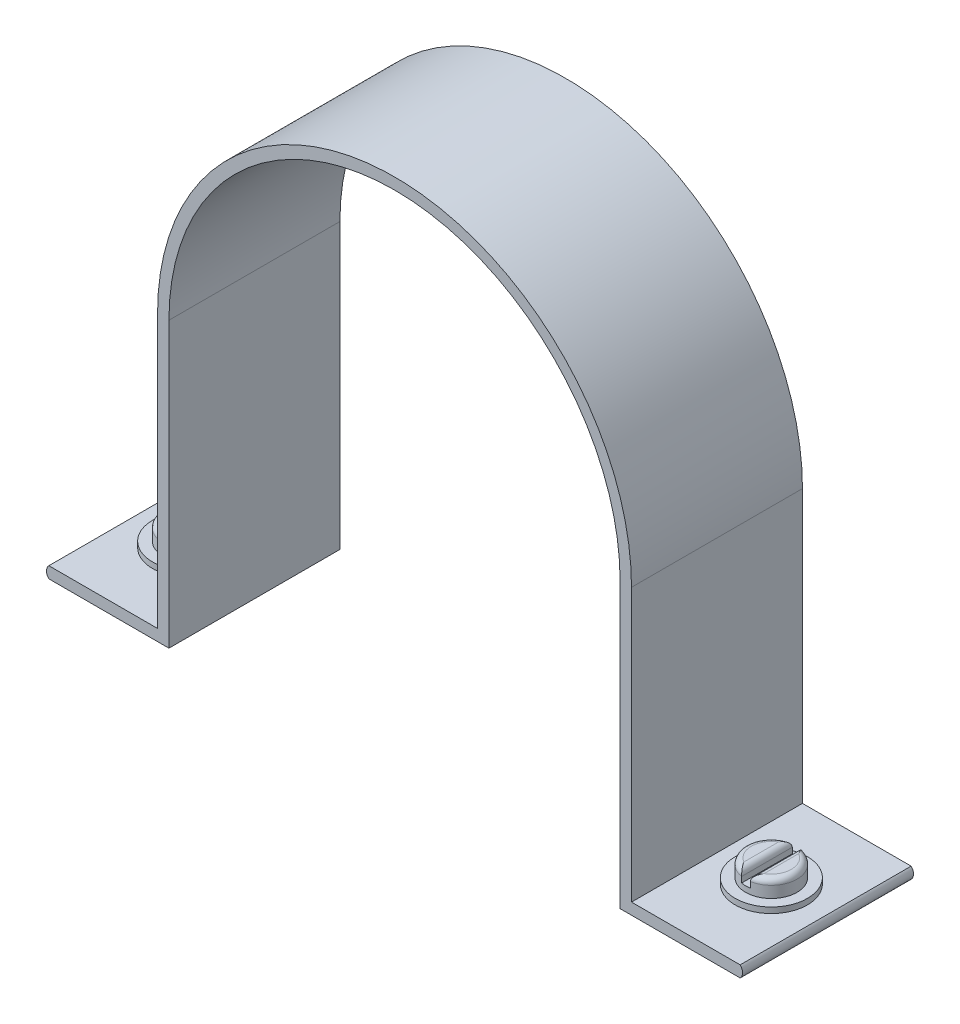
ISO-10303-21;
HEADER;
FILE_DESCRIPTION(('STEP AP214'),'2;1');
FILE_NAME('part.step','',(''),(''),'','','');
FILE_SCHEMA(('AUTOMOTIVE_DESIGN { 1 0 10303 214 1 1 1 1 }'));
ENDSEC;
DATA;
#1=APPLICATION_CONTEXT('core data for automotive mechanical design processes');
#2=APPLICATION_PROTOCOL_DEFINITION('international standard','automotive_design',2000,#1);
#3=PRODUCT_CONTEXT('',#1,'mechanical');
#4=PRODUCT('Part','Part','',(#3));
#5=PRODUCT_RELATED_PRODUCT_CATEGORY('part','',(#4));
#6=PRODUCT_DEFINITION_FORMATION('','',#4);
#7=PRODUCT_DEFINITION_CONTEXT('part definition',#1,'design');
#8=PRODUCT_DEFINITION('design','',#6,#7);
#9=PRODUCT_DEFINITION_SHAPE('','',#8);
#10=(LENGTH_UNIT() NAMED_UNIT(*) SI_UNIT(.MILLI.,.METRE.));
#11=(NAMED_UNIT(*) PLANE_ANGLE_UNIT() SI_UNIT($,.RADIAN.));
#12=(NAMED_UNIT(*) SI_UNIT($,.STERADIAN.) SOLID_ANGLE_UNIT());
#13=UNCERTAINTY_MEASURE_WITH_UNIT(LENGTH_MEASURE(1.E-05),#10,'distance_accuracy_value','');
#14=(GEOMETRIC_REPRESENTATION_CONTEXT(3) GLOBAL_UNCERTAINTY_ASSIGNED_CONTEXT((#13)) GLOBAL_UNIT_ASSIGNED_CONTEXT((#10,
#11,#12)) REPRESENTATION_CONTEXT('',''));
#15=CARTESIAN_POINT('',(0.,0.,0.));
#16=DIRECTION('',(0.,0.,1.));
#17=DIRECTION('',(1.,0.,0.));
#18=AXIS2_PLACEMENT_3D('',#15,#16,#17);
#19=CARTESIAN_POINT('',(-51.1186134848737,-41.8383769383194,15.));
#20=DIRECTION('',(0.,-1.,0.));
#21=DIRECTION('',(0.,0.,-1.));
#22=AXIS2_PLACEMENT_3D('',#19,#20,#21);
#23=PLANE('',#22);
#24=CARTESIAN_POINT('',(-51.1186134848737,-41.8383769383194,15.));
#25=DIRECTION('',(0.,-1.,0.));
#26=DIRECTION('',(0.,0.,-1.));
#27=AXIS2_PLACEMENT_3D('',#24,#25,#26);
#28=CIRCLE('',#27,3.51164734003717);
#29=CARTESIAN_POINT('',(-49.3508449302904,-41.8383769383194,18.0342480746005));
#30=VERTEX_POINT('',#29);
#31=CARTESIAN_POINT('',(-49.3508449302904,-41.8383769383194,11.9657519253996));
#32=VERTEX_POINT('',#31);
#33=EDGE_CURVE('E51',#30,#32,#28,.F.);
#34=ORIENTED_EDGE('',*,*,#33,.T.);
#35=DIRECTION('',(0.,0.,1.));
#36=VECTOR('',#35,1.);
#37=CARTESIAN_POINT('',(-49.3508449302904,-41.8383769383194,15.));
#38=LINE('',#37,#36);
#39=EDGE_CURVE('E44',#32,#30,#38,.T.);
#40=ORIENTED_EDGE('',*,*,#39,.T.);
#41=EDGE_LOOP('',(#34,#40));
#42=FACE_BOUND('',#41,.T.);
#43=ADVANCED_FACE('F31',(#42),#23,.F.);
#44=CARTESIAN_POINT('',(51.1186134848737,-41.8383769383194,15.));
#45=DIRECTION('',(0.,1.,0.));
#46=DIRECTION('',(0.,0.,1.));
#47=AXIS2_PLACEMENT_3D('',#44,#45,#46);
#48=PLANE('',#47);
#49=DIRECTION('',(0.,0.,-1.));
#50=VECTOR('',#49,1.);
#51=CARTESIAN_POINT('',(52.886382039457,-41.8383769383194,19.4458399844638));
#52=LINE('',#51,#50);
#53=CARTESIAN_POINT('',(52.886382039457,-41.8383769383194,11.9657519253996));
#54=VERTEX_POINT('',#53);
#55=CARTESIAN_POINT('',(52.886382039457,-41.8383769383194,18.0342480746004));
#56=VERTEX_POINT('',#55);
#57=EDGE_CURVE('E375',#54,#56,#52,.F.);
#58=ORIENTED_EDGE('',*,*,#57,.T.);
#59=CARTESIAN_POINT('',(51.1186134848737,-41.8383769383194,15.));
#60=DIRECTION('',(0.,1.,0.));
#61=DIRECTION('',(0.,0.,1.));
#62=AXIS2_PLACEMENT_3D('',#59,#60,#61);
#63=CIRCLE('',#62,3.51164734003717);
#64=EDGE_CURVE('E377',#56,#54,#63,.T.);
#65=ORIENTED_EDGE('',*,*,#64,.T.);
#66=EDGE_LOOP('',(#58,#65));
#67=FACE_BOUND('',#66,.T.);
#68=ADVANCED_FACE('F470',(#67),#48,.T.);
#69=CARTESIAN_POINT('',(-51.1186134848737,-44.8383769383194,15.));
#70=DIRECTION('',(0.,-1.,0.));
#71=DIRECTION('',(0.,0.,-1.));
#72=AXIS2_PLACEMENT_3D('',#69,#70,#71);
#73=PLANE('',#72);
#74=CARTESIAN_POINT('',(-51.1186134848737,-44.8383769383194,15.));
#75=DIRECTION('',(0.,1.,0.));
#76=DIRECTION('',(0.,0.,-1.));
#77=AXIS2_PLACEMENT_3D('',#74,#75,#76);
#78=CIRCLE('',#77,6.33718830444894);
#79=CARTESIAN_POINT('',(-51.1186134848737,-44.8383769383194,8.66281169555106));
#80=VERTEX_POINT('',#79);
#81=EDGE_CURVE('E258',#80,#80,#78,.T.);
#82=ORIENTED_EDGE('',*,*,#81,.T.);
#83=EDGE_LOOP('',(#82));
#84=FACE_BOUND('',#83,.T.);
#85=CARTESIAN_POINT('',(-51.1186134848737,-44.8383769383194,15.));
#86=DIRECTION('',(0.,-1.,0.));
#87=DIRECTION('',(0.,0.,-1.));
#88=AXIS2_PLACEMENT_3D('',#85,#86,#87);
#89=CIRCLE('',#88,4.51164734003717);
#90=CARTESIAN_POINT('',(-51.1186134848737,-44.8383769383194,10.4883526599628));
#91=VERTEX_POINT('',#90);
#92=EDGE_CURVE('E356',#91,#91,#89,.F.);
#93=ORIENTED_EDGE('',*,*,#92,.F.);
#94=EDGE_LOOP('',(#93));
#95=FACE_BOUND('',#94,.T.);
#96=ADVANCED_FACE('F476',(#84,#95),#73,.F.);
#97=CARTESIAN_POINT('',(51.1186134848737,-44.8383769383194,15.));
#98=DIRECTION('',(0.,1.,0.));
#99=DIRECTION('',(0.,0.,1.));
#100=AXIS2_PLACEMENT_3D('',#97,#98,#99);
#101=PLANE('',#100);
#102=CARTESIAN_POINT('',(51.1186134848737,-44.8383769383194,15.));
#103=DIRECTION('',(0.,1.,0.));
#104=DIRECTION('',(0.,0.,1.));
#105=AXIS2_PLACEMENT_3D('',#102,#103,#104);
#106=CIRCLE('',#105,6.33718830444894);
#107=CARTESIAN_POINT('',(51.1186134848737,-44.8383769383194,21.3371883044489));
#108=VERTEX_POINT('',#107);
#109=EDGE_CURVE('E261',#108,#108,#106,.T.);
#110=ORIENTED_EDGE('',*,*,#109,.T.);
#111=EDGE_LOOP('',(#110));
#112=FACE_BOUND('',#111,.T.);
#113=CARTESIAN_POINT('',(51.1186134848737,-44.8383769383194,15.));
#114=DIRECTION('',(0.,1.,0.));
#115=DIRECTION('',(0.,0.,1.));
#116=AXIS2_PLACEMENT_3D('',#113,#114,#115);
#117=CIRCLE('',#116,4.51164734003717);
#118=CARTESIAN_POINT('',(51.1186134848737,-44.8383769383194,19.5116473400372));
#119=VERTEX_POINT('',#118);
#120=EDGE_CURVE('E255',#119,#119,#117,.T.);
#121=ORIENTED_EDGE('',*,*,#120,.F.);
#122=EDGE_LOOP('',(#121));
#123=FACE_BOUND('',#122,.T.);
#124=ADVANCED_FACE('F622',(#112,#123),#101,.T.);
#125=CARTESIAN_POINT('',(-41.5838112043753,-45.8383769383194,30.));
#126=DIRECTION('',(0.,-1.,0.));
#127=DIRECTION('',(0.,0.,-1.));
#128=AXIS2_PLACEMENT_3D('',#125,#126,#127);
#129=PLANE('',#128);
#130=DIRECTION('',(-1.,0.,0.));
#131=VECTOR('',#130,1.);
#132=CARTESIAN_POINT('',(-41.5838112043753,-45.8383769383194,0.));
#133=LINE('',#132,#131);
#134=CARTESIAN_POINT('',(-41.5838112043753,-45.8383769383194,0.));
#135=VERTEX_POINT('',#134);
#136=CARTESIAN_POINT('',(-60.6534157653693,-45.8383769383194,0.));
#137=VERTEX_POINT('',#136);
#138=EDGE_CURVE('E298',#135,#137,#133,.T.);
#139=ORIENTED_EDGE('',*,*,#138,.T.);
#140=DIRECTION('',(0.,0.,-1.));
#141=VECTOR('',#140,1.);
#142=CARTESIAN_POINT('',(-60.6534157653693,-45.8383769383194,30.));
#143=LINE('',#142,#141);
#144=CARTESIAN_POINT('',(-60.6534157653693,-45.8383769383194,30.));
#145=VERTEX_POINT('',#144);
#146=EDGE_CURVE('E338',#145,#137,#143,.T.);
#147=ORIENTED_EDGE('',*,*,#146,.F.);
#148=DIRECTION('',(-1.,0.,0.));
#149=VECTOR('',#148,1.);
#150=CARTESIAN_POINT('',(-41.5838112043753,-45.8383769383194,30.));
#151=LINE('',#150,#149);
#152=CARTESIAN_POINT('',(-41.5838112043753,-45.8383769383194,30.));
#153=VERTEX_POINT('',#152);
#154=EDGE_CURVE('E273',#153,#145,#151,.T.);
#155=ORIENTED_EDGE('',*,*,#154,.F.);
#156=DIRECTION('',(0.,0.,-1.));
#157=VECTOR('',#156,1.);
#158=CARTESIAN_POINT('',(-41.5838112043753,-45.8383769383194,30.));
#159=LINE('',#158,#157);
#160=EDGE_CURVE('E341',#153,#135,#159,.T.);
#161=ORIENTED_EDGE('',*,*,#160,.T.);
#162=EDGE_LOOP('',(#139,#147,#155,#161));
#163=FACE_BOUND('',#162,.T.);
#164=CARTESIAN_POINT('',(-51.1186134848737,-45.8383769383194,15.));
#165=DIRECTION('',(0.,-1.,0.));
#166=DIRECTION('',(0.,0.,-1.));
#167=AXIS2_PLACEMENT_3D('',#164,#165,#166);
#168=CIRCLE('',#167,6.33718830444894);
#169=CARTESIAN_POINT('',(-51.1186134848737,-45.8383769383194,8.66281169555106));
#170=VERTEX_POINT('',#169);
#171=EDGE_CURVE('E353',#170,#170,#168,.F.);
#172=ORIENTED_EDGE('',*,*,#171,.F.);
#173=EDGE_LOOP('',(#172));
#174=FACE_BOUND('',#173,.T.);
#175=ADVANCED_FACE('F631',(#163,#174),#129,.F.);
#176=CARTESIAN_POINT('',(41.5838112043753,-45.8383769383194,30.));
#177=DIRECTION('',(0.,-1.,0.));
#178=DIRECTION('',(0.,0.,-1.));
#179=AXIS2_PLACEMENT_3D('',#176,#177,#178);
#180=PLANE('',#179);
#181=DIRECTION('',(-1.,0.,0.));
#182=VECTOR('',#181,1.);
#183=CARTESIAN_POINT('',(41.5838112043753,-45.8383769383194,0.));
#184=LINE('',#183,#182);
#185=CARTESIAN_POINT('',(60.6534157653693,-45.8383769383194,0.));
#186=VERTEX_POINT('',#185);
#187=CARTESIAN_POINT('',(41.5838112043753,-45.8383769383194,0.));
#188=VERTEX_POINT('',#187);
#189=EDGE_CURVE('E269',#186,#188,#184,.T.);
#190=ORIENTED_EDGE('',*,*,#189,.T.);
#191=DIRECTION('',(0.,0.,-1.));
#192=VECTOR('',#191,1.);
#193=CARTESIAN_POINT('',(41.5838112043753,-45.8383769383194,30.));
#194=LINE('',#193,#192);
#195=CARTESIAN_POINT('',(41.5838112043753,-45.8383769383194,30.));
#196=VERTEX_POINT('',#195);
#197=EDGE_CURVE('E291',#196,#188,#194,.T.);
#198=ORIENTED_EDGE('',*,*,#197,.F.);
#199=DIRECTION('',(-1.,0.,0.));
#200=VECTOR('',#199,1.);
#201=CARTESIAN_POINT('',(41.5838112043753,-45.8383769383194,30.));
#202=LINE('',#201,#200);
#203=CARTESIAN_POINT('',(60.6534157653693,-45.8383769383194,30.));
#204=VERTEX_POINT('',#203);
#205=EDGE_CURVE('E289',#204,#196,#202,.T.);
#206=ORIENTED_EDGE('',*,*,#205,.F.);
#207=DIRECTION('',(0.,0.,-1.));
#208=VECTOR('',#207,1.);
#209=CARTESIAN_POINT('',(60.6534157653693,-45.8383769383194,30.));
#210=LINE('',#209,#208);
#211=EDGE_CURVE('E317',#204,#186,#210,.T.);
#212=ORIENTED_EDGE('',*,*,#211,.T.);
#213=EDGE_LOOP('',(#190,#198,#206,#212));
#214=FACE_BOUND('',#213,.T.);
#215=CARTESIAN_POINT('',(51.1186134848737,-45.8383769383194,15.));
#216=DIRECTION('',(0.,-1.,0.));
#217=DIRECTION('',(0.,0.,-1.));
#218=AXIS2_PLACEMENT_3D('',#215,#216,#217);
#219=CIRCLE('',#218,6.33718830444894);
#220=CARTESIAN_POINT('',(51.1186134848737,-45.8383769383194,8.66281169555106));
#221=VERTEX_POINT('',#220);
#222=EDGE_CURVE('E350',#221,#221,#219,.F.);
#223=ORIENTED_EDGE('',*,*,#222,.F.);
#224=EDGE_LOOP('',(#223));
#225=FACE_BOUND('',#224,.T.);
#226=ADVANCED_FACE('F658',(#214,#225),#180,.F.);
#227=CARTESIAN_POINT('',(41.5838112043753,2.00000000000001,30.));
#228=DIRECTION('',(-1.,0.,0.));
#229=DIRECTION('',(0.,-1.,0.));
#230=AXIS2_PLACEMENT_3D('',#227,#228,#229);
#231=PLANE('',#230);
#232=DIRECTION('',(0.,1.,0.));
#233=VECTOR('',#232,1.);
#234=CARTESIAN_POINT('',(41.5838112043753,2.00000000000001,0.));
#235=LINE('',#234,#233);
#236=CARTESIAN_POINT('',(41.5838112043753,2.00000000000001,0.));
#237=VERTEX_POINT('',#236);
#238=EDGE_CURVE('E264',#188,#237,#235,.T.);
#239=ORIENTED_EDGE('',*,*,#238,.T.);
#240=DIRECTION('',(0.,0.,-1.));
#241=VECTOR('',#240,1.);
#242=CARTESIAN_POINT('',(41.5838112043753,2.00000000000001,30.));
#243=LINE('',#242,#241);
#244=CARTESIAN_POINT('',(41.5838112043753,2.00000000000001,30.));
#245=VERTEX_POINT('',#244);
#246=EDGE_CURVE('E347',#245,#237,#243,.T.);
#247=ORIENTED_EDGE('',*,*,#246,.F.);
#248=DIRECTION('',(0.,1.,0.));
#249=VECTOR('',#248,1.);
#250=CARTESIAN_POINT('',(41.5838112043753,2.00000000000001,30.));
#251=LINE('',#250,#249);
#252=EDGE_CURVE('E265',#196,#245,#251,.T.);
#253=ORIENTED_EDGE('',*,*,#252,.F.);
#254=ORIENTED_EDGE('',*,*,#197,.T.);
#255=EDGE_LOOP('',(#239,#247,#253,#254));
#256=FACE_BOUND('',#255,.T.);
#257=ADVANCED_FACE('F667',(#256),#231,.F.);
#258=CARTESIAN_POINT('',(0.,2.,30.));
#259=DIRECTION('',(0.,0.,-1.));
#260=DIRECTION('',(-1.,0.,0.));
#261=AXIS2_PLACEMENT_3D('',#258,#259,#260);
#262=CYLINDRICAL_SURFACE('',#261,41.5838112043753);
#263=CARTESIAN_POINT('',(0.,2.,0.));
#264=DIRECTION('',(0.,0.,1.));
#265=DIRECTION('',(1.,0.,0.));
#266=AXIS2_PLACEMENT_3D('',#263,#264,#265);
#267=CIRCLE('',#266,41.5838112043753);
#268=CARTESIAN_POINT('',(-41.5838112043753,2.,0.));
#269=VERTEX_POINT('',#268);
#270=EDGE_CURVE('E294',#237,#269,#267,.T.);
#271=ORIENTED_EDGE('',*,*,#270,.T.);
#272=DIRECTION('',(0.,0.,-1.));
#273=VECTOR('',#272,1.);
#274=CARTESIAN_POINT('',(-41.5838112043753,2.,30.));
#275=LINE('',#274,#273);
#276=CARTESIAN_POINT('',(-41.5838112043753,2.,30.));
#277=VERTEX_POINT('',#276);
#278=EDGE_CURVE('E344',#277,#269,#275,.T.);
#279=ORIENTED_EDGE('',*,*,#278,.F.);
#280=CARTESIAN_POINT('',(0.,2.,30.));
#281=DIRECTION('',(0.,0.,1.));
#282=DIRECTION('',(1.,0.,0.));
#283=AXIS2_PLACEMENT_3D('',#280,#281,#282);
#284=CIRCLE('',#283,41.5838112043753);
#285=EDGE_CURVE('E268',#245,#277,#284,.T.);
#286=ORIENTED_EDGE('',*,*,#285,.F.);
#287=ORIENTED_EDGE('',*,*,#246,.T.);
#288=EDGE_LOOP('',(#271,#279,#286,#287));
#289=FACE_BOUND('',#288,.T.);
#290=ADVANCED_FACE('F756',(#289),#262,.T.);
#291=CARTESIAN_POINT('',(-41.5838112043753,2.,30.));
#292=DIRECTION('',(1.,0.,0.));
#293=DIRECTION('',(0.,0.,-1.));
#294=AXIS2_PLACEMENT_3D('',#291,#292,#293);
#295=PLANE('',#294);
#296=DIRECTION('',(0.,-1.,0.));
#297=VECTOR('',#296,1.);
#298=CARTESIAN_POINT('',(-41.5838112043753,2.,0.));
#299=LINE('',#298,#297);
#300=EDGE_CURVE('E296',#269,#135,#299,.T.);
#301=ORIENTED_EDGE('',*,*,#300,.T.);
#302=ORIENTED_EDGE('',*,*,#160,.F.);
#303=DIRECTION('',(0.,-1.,0.));
#304=VECTOR('',#303,1.);
#305=CARTESIAN_POINT('',(-41.5838112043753,2.,30.));
#306=LINE('',#305,#304);
#307=EDGE_CURVE('E271',#277,#153,#306,.T.);
#308=ORIENTED_EDGE('',*,*,#307,.F.);
#309=ORIENTED_EDGE('',*,*,#278,.T.);
#310=EDGE_LOOP('',(#301,#302,#308,#309));
#311=FACE_BOUND('',#310,.T.);
#312=ADVANCED_FACE('F747',(#311),#295,.F.);
#313=CARTESIAN_POINT('',(-59.6534157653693,-46.8383769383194,30.));
#314=DIRECTION('',(0.,0.,-1.));
#315=DIRECTION('',(-1.,0.,0.));
#316=AXIS2_PLACEMENT_3D('',#313,#314,#315);
#317=CYLINDRICAL_SURFACE('',#316,1.41421356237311);
#318=CARTESIAN_POINT('',(-59.6534157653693,-46.8383769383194,0.));
#319=DIRECTION('',(0.,0.,1.));
#320=DIRECTION('',(-1.,0.,0.));
#321=AXIS2_PLACEMENT_3D('',#318,#319,#320);
#322=CIRCLE('',#321,1.41421356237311);
#323=CARTESIAN_POINT('',(-60.6534157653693,-47.8383769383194,0.));
#324=VERTEX_POINT('',#323);
#325=EDGE_CURVE('E300',#137,#324,#322,.T.);
#326=ORIENTED_EDGE('',*,*,#325,.T.);
#327=DIRECTION('',(0.,0.,-1.));
#328=VECTOR('',#327,1.);
#329=CARTESIAN_POINT('',(-60.6534157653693,-47.8383769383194,30.));
#330=LINE('',#329,#328);
#331=CARTESIAN_POINT('',(-60.6534157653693,-47.8383769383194,30.));
#332=VERTEX_POINT('',#331);
#333=EDGE_CURVE('E335',#332,#324,#330,.T.);
#334=ORIENTED_EDGE('',*,*,#333,.F.);
#335=CARTESIAN_POINT('',(-59.6534157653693,-46.8383769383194,30.));
#336=DIRECTION('',(0.,0.,1.));
#337=DIRECTION('',(-1.,0.,0.));
#338=AXIS2_PLACEMENT_3D('',#335,#336,#337);
#339=CIRCLE('',#338,1.41421356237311);
#340=EDGE_CURVE('E275',#145,#332,#339,.T.);
#341=ORIENTED_EDGE('',*,*,#340,.F.);
#342=ORIENTED_EDGE('',*,*,#146,.T.);
#343=EDGE_LOOP('',(#326,#334,#341,#342));
#344=FACE_BOUND('',#343,.T.);
#345=ADVANCED_FACE('F738',(#344),#317,.T.);
#346=CARTESIAN_POINT('',(-39.5838112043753,-47.8383769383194,30.));
#347=DIRECTION('',(0.,1.,0.));
#348=DIRECTION('',(0.,0.,1.));
#349=AXIS2_PLACEMENT_3D('',#346,#347,#348);
#350=PLANE('',#349);
#351=DIRECTION('',(1.,0.,0.));
#352=VECTOR('',#351,1.);
#353=CARTESIAN_POINT('',(-39.5838112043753,-47.8383769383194,0.));
#354=LINE('',#353,#352);
#355=CARTESIAN_POINT('',(-39.5838112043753,-47.8383769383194,0.));
#356=VERTEX_POINT('',#355);
#357=EDGE_CURVE('E302',#324,#356,#354,.T.);
#358=ORIENTED_EDGE('',*,*,#357,.T.);
#359=DIRECTION('',(0.,0.,-1.));
#360=VECTOR('',#359,1.);
#361=CARTESIAN_POINT('',(-39.5838112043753,-47.8383769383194,30.));
#362=LINE('',#361,#360);
#363=CARTESIAN_POINT('',(-39.5838112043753,-47.8383769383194,30.));
#364=VERTEX_POINT('',#363);
#365=EDGE_CURVE('E332',#364,#356,#362,.T.);
#366=ORIENTED_EDGE('',*,*,#365,.F.);
#367=DIRECTION('',(1.,0.,0.));
#368=VECTOR('',#367,1.);
#369=CARTESIAN_POINT('',(-39.5838112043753,-47.8383769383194,30.));
#370=LINE('',#369,#368);
#371=EDGE_CURVE('E277',#332,#364,#370,.T.);
#372=ORIENTED_EDGE('',*,*,#371,.F.);
#373=ORIENTED_EDGE('',*,*,#333,.T.);
#374=EDGE_LOOP('',(#358,#366,#372,#373));
#375=FACE_BOUND('',#374,.T.);
#376=ADVANCED_FACE('F729',(#375),#350,.F.);
#377=CARTESIAN_POINT('',(-39.5838112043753,2.,30.));
#378=DIRECTION('',(-1.,0.,0.));
#379=DIRECTION('',(0.,-1.,0.));
#380=AXIS2_PLACEMENT_3D('',#377,#378,#379);
#381=PLANE('',#380);
#382=DIRECTION('',(0.,1.,0.));
#383=VECTOR('',#382,1.);
#384=CARTESIAN_POINT('',(-39.5838112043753,2.,0.));
#385=LINE('',#384,#383);
#386=CARTESIAN_POINT('',(-39.5838112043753,2.,0.));
#387=VERTEX_POINT('',#386);
#388=EDGE_CURVE('E304',#356,#387,#385,.T.);
#389=ORIENTED_EDGE('',*,*,#388,.T.);
#390=DIRECTION('',(0.,0.,-1.));
#391=VECTOR('',#390,1.);
#392=CARTESIAN_POINT('',(-39.5838112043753,2.,30.));
#393=LINE('',#392,#391);
#394=CARTESIAN_POINT('',(-39.5838112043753,2.,30.));
#395=VERTEX_POINT('',#394);
#396=EDGE_CURVE('E329',#395,#387,#393,.T.);
#397=ORIENTED_EDGE('',*,*,#396,.F.);
#398=DIRECTION('',(0.,1.,0.));
#399=VECTOR('',#398,1.);
#400=CARTESIAN_POINT('',(-39.5838112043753,2.,30.));
#401=LINE('',#400,#399);
#402=EDGE_CURVE('E279',#364,#395,#401,.T.);
#403=ORIENTED_EDGE('',*,*,#402,.F.);
#404=ORIENTED_EDGE('',*,*,#365,.T.);
#405=EDGE_LOOP('',(#389,#397,#403,#404));
#406=FACE_BOUND('',#405,.T.);
#407=ADVANCED_FACE('F720',(#406),#381,.F.);
#408=CARTESIAN_POINT('',(0.,2.,30.));
#409=DIRECTION('',(0.,0.,-1.));
#410=DIRECTION('',(-1.,0.,0.));
#411=AXIS2_PLACEMENT_3D('',#408,#409,#410);
#412=CYLINDRICAL_SURFACE('',#411,39.5838112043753);
#413=CARTESIAN_POINT('',(0.,2.,0.));
#414=DIRECTION('',(0.,0.,-1.));
#415=DIRECTION('',(1.,0.,0.));
#416=AXIS2_PLACEMENT_3D('',#413,#414,#415);
#417=CIRCLE('',#416,39.5838112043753);
#418=CARTESIAN_POINT('',(39.5838112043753,2.,0.));
#419=VERTEX_POINT('',#418);
#420=EDGE_CURVE('E306',#387,#419,#417,.T.);
#421=ORIENTED_EDGE('',*,*,#420,.T.);
#422=DIRECTION('',(0.,0.,-1.));
#423=VECTOR('',#422,1.);
#424=CARTESIAN_POINT('',(39.5838112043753,2.,30.));
#425=LINE('',#424,#423);
#426=CARTESIAN_POINT('',(39.5838112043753,2.,30.));
#427=VERTEX_POINT('',#426);
#428=EDGE_CURVE('E326',#427,#419,#425,.T.);
#429=ORIENTED_EDGE('',*,*,#428,.F.);
#430=CARTESIAN_POINT('',(0.,2.,30.));
#431=DIRECTION('',(0.,0.,-1.));
#432=DIRECTION('',(1.,0.,0.));
#433=AXIS2_PLACEMENT_3D('',#430,#431,#432);
#434=CIRCLE('',#433,39.5838112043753);
#435=EDGE_CURVE('E281',#395,#427,#434,.T.);
#436=ORIENTED_EDGE('',*,*,#435,.F.);
#437=ORIENTED_EDGE('',*,*,#396,.T.);
#438=EDGE_LOOP('',(#421,#429,#436,#437));
#439=FACE_BOUND('',#438,.T.);
#440=ADVANCED_FACE('F711',(#439),#412,.F.);
#441=CARTESIAN_POINT('',(39.5838112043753,2.,30.));
#442=DIRECTION('',(1.,0.,0.));
#443=DIRECTION('',(0.,1.,0.));
#444=AXIS2_PLACEMENT_3D('',#441,#442,#443);
#445=PLANE('',#444);
#446=DIRECTION('',(0.,-1.,0.));
#447=VECTOR('',#446,1.);
#448=CARTESIAN_POINT('',(39.5838112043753,2.,0.));
#449=LINE('',#448,#447);
#450=CARTESIAN_POINT('',(39.5838112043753,-47.8383769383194,0.));
#451=VERTEX_POINT('',#450);
#452=EDGE_CURVE('E308',#419,#451,#449,.T.);
#453=ORIENTED_EDGE('',*,*,#452,.T.);
#454=DIRECTION('',(0.,0.,-1.));
#455=VECTOR('',#454,1.);
#456=CARTESIAN_POINT('',(39.5838112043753,-47.8383769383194,30.));
#457=LINE('',#456,#455);
#458=CARTESIAN_POINT('',(39.5838112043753,-47.8383769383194,30.));
#459=VERTEX_POINT('',#458);
#460=EDGE_CURVE('E323',#459,#451,#457,.T.);
#461=ORIENTED_EDGE('',*,*,#460,.F.);
#462=DIRECTION('',(0.,-1.,0.));
#463=VECTOR('',#462,1.);
#464=CARTESIAN_POINT('',(39.5838112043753,2.,30.));
#465=LINE('',#464,#463);
#466=EDGE_CURVE('E283',#427,#459,#465,.T.);
#467=ORIENTED_EDGE('',*,*,#466,.F.);
#468=ORIENTED_EDGE('',*,*,#428,.T.);
#469=EDGE_LOOP('',(#453,#461,#467,#468));
#470=FACE_BOUND('',#469,.T.);
#471=ADVANCED_FACE('F702',(#470),#445,.F.);
#472=CARTESIAN_POINT('',(39.5838112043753,-47.8383769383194,30.));
#473=DIRECTION('',(0.,1.,0.));
#474=DIRECTION('',(0.,0.,1.));
#475=AXIS2_PLACEMENT_3D('',#472,#473,#474);
#476=PLANE('',#475);
#477=DIRECTION('',(1.,0.,0.));
#478=VECTOR('',#477,1.);
#479=CARTESIAN_POINT('',(39.5838112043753,-47.8383769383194,0.));
#480=LINE('',#479,#478);
#481=CARTESIAN_POINT('',(60.6534157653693,-47.8383769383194,0.));
#482=VERTEX_POINT('',#481);
#483=EDGE_CURVE('E310',#451,#482,#480,.T.);
#484=ORIENTED_EDGE('',*,*,#483,.T.);
#485=DIRECTION('',(0.,0.,-1.));
#486=VECTOR('',#485,1.);
#487=CARTESIAN_POINT('',(60.6534157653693,-47.8383769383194,30.));
#488=LINE('',#487,#486);
#489=CARTESIAN_POINT('',(60.6534157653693,-47.8383769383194,30.));
#490=VERTEX_POINT('',#489);
#491=EDGE_CURVE('E320',#490,#482,#488,.T.);
#492=ORIENTED_EDGE('',*,*,#491,.F.);
#493=DIRECTION('',(1.,0.,0.));
#494=VECTOR('',#493,1.);
#495=CARTESIAN_POINT('',(39.5838112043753,-47.8383769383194,30.));
#496=LINE('',#495,#494);
#497=EDGE_CURVE('E285',#459,#490,#496,.T.);
#498=ORIENTED_EDGE('',*,*,#497,.F.);
#499=ORIENTED_EDGE('',*,*,#460,.T.);
#500=EDGE_LOOP('',(#484,#492,#498,#499));
#501=FACE_BOUND('',#500,.T.);
#502=ADVANCED_FACE('F693',(#501),#476,.F.);
#503=CARTESIAN_POINT('',(59.6534157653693,-46.8383769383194,30.));
#504=DIRECTION('',(0.,0.,-1.));
#505=DIRECTION('',(-1.,0.,0.));
#506=AXIS2_PLACEMENT_3D('',#503,#504,#505);
#507=CYLINDRICAL_SURFACE('',#506,1.4142135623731);
#508=CARTESIAN_POINT('',(59.6534157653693,-46.8383769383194,0.));
#509=DIRECTION('',(0.,0.,1.));
#510=DIRECTION('',(1.,0.,0.));
#511=AXIS2_PLACEMENT_3D('',#508,#509,#510);
#512=CIRCLE('',#511,1.4142135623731);
#513=EDGE_CURVE('E312',#482,#186,#512,.T.);
#514=ORIENTED_EDGE('',*,*,#513,.T.);
#515=ORIENTED_EDGE('',*,*,#211,.F.);
#516=CARTESIAN_POINT('',(59.6534157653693,-46.8383769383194,30.));
#517=DIRECTION('',(0.,0.,1.));
#518=DIRECTION('',(1.,0.,0.));
#519=AXIS2_PLACEMENT_3D('',#516,#517,#518);
#520=CIRCLE('',#519,1.4142135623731);
#521=EDGE_CURVE('E287',#490,#204,#520,.T.);
#522=ORIENTED_EDGE('',*,*,#521,.F.);
#523=ORIENTED_EDGE('',*,*,#491,.T.);
#524=EDGE_LOOP('',(#514,#515,#522,#523));
#525=FACE_BOUND('',#524,.T.);
#526=ADVANCED_FACE('F684',(#525),#507,.T.);
#527=CARTESIAN_POINT('',(59.6534157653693,-46.8383769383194,30.));
#528=DIRECTION('',(0.,0.,1.));
#529=DIRECTION('',(1.,0.,0.));
#530=AXIS2_PLACEMENT_3D('',#527,#528,#529);
#531=PLANE('',#530);
#532=ORIENTED_EDGE('',*,*,#252,.T.);
#533=ORIENTED_EDGE('',*,*,#285,.T.);
#534=ORIENTED_EDGE('',*,*,#307,.T.);
#535=ORIENTED_EDGE('',*,*,#154,.T.);
#536=ORIENTED_EDGE('',*,*,#340,.T.);
#537=ORIENTED_EDGE('',*,*,#371,.T.);
#538=ORIENTED_EDGE('',*,*,#402,.T.);
#539=ORIENTED_EDGE('',*,*,#435,.T.);
#540=ORIENTED_EDGE('',*,*,#466,.T.);
#541=ORIENTED_EDGE('',*,*,#497,.T.);
#542=ORIENTED_EDGE('',*,*,#521,.T.);
#543=ORIENTED_EDGE('',*,*,#205,.T.);
#544=EDGE_LOOP('',(#532,#533,#534,#535,#536,#537,#538,#539,#540,#541,#542,#543));
#545=FACE_BOUND('',#544,.T.);
#546=ADVANCED_FACE('F675',(#545),#531,.T.);
#547=CARTESIAN_POINT('',(59.6534157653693,-46.8383769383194,0.));
#548=DIRECTION('',(0.,0.,1.));
#549=DIRECTION('',(1.,0.,0.));
#550=AXIS2_PLACEMENT_3D('',#547,#548,#549);
#551=PLANE('',#550);
#552=ORIENTED_EDGE('',*,*,#238,.F.);
#553=ORIENTED_EDGE('',*,*,#189,.F.);
#554=ORIENTED_EDGE('',*,*,#513,.F.);
#555=ORIENTED_EDGE('',*,*,#483,.F.);
#556=ORIENTED_EDGE('',*,*,#452,.F.);
#557=ORIENTED_EDGE('',*,*,#420,.F.);
#558=ORIENTED_EDGE('',*,*,#388,.F.);
#559=ORIENTED_EDGE('',*,*,#357,.F.);
#560=ORIENTED_EDGE('',*,*,#325,.F.);
#561=ORIENTED_EDGE('',*,*,#138,.F.);
#562=ORIENTED_EDGE('',*,*,#300,.F.);
#563=ORIENTED_EDGE('',*,*,#270,.F.);
#564=EDGE_LOOP('',(#552,#553,#554,#555,#556,#557,#558,#559,#560,#561,#562,#563));
#565=FACE_BOUND('',#564,.T.);
#566=ADVANCED_FACE('F648',(#565),#551,.F.);
#567=CARTESIAN_POINT('',(51.1186134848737,-44.8383769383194,15.));
#568=DIRECTION('',(0.,-1.,0.));
#569=DIRECTION('',(0.,0.,-1.));
#570=AXIS2_PLACEMENT_3D('',#567,#568,#569);
#571=CYLINDRICAL_SURFACE('',#570,6.33718830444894);
#572=ORIENTED_EDGE('',*,*,#109,.F.);
#573=EDGE_LOOP('',(#572));
#574=FACE_BOUND('',#573,.T.);
#575=ORIENTED_EDGE('',*,*,#222,.T.);
#576=EDGE_LOOP('',(#575));
#577=FACE_BOUND('',#576,.T.);
#578=ADVANCED_FACE('F639',(#574,#577),#571,.T.);
#579=CARTESIAN_POINT('',(-51.1186134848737,-44.8383769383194,15.));
#580=DIRECTION('',(0.,-1.,0.));
#581=DIRECTION('',(0.,0.,-1.));
#582=AXIS2_PLACEMENT_3D('',#579,#580,#581);
#583=CYLINDRICAL_SURFACE('',#582,6.33718830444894);
#584=ORIENTED_EDGE('',*,*,#81,.F.);
#585=EDGE_LOOP('',(#584));
#586=FACE_BOUND('',#585,.T.);
#587=ORIENTED_EDGE('',*,*,#171,.T.);
#588=EDGE_LOOP('',(#587));
#589=FACE_BOUND('',#588,.T.);
#590=ADVANCED_FACE('F613',(#586,#589),#583,.T.);
#591=CARTESIAN_POINT('',(51.1186134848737,-41.8383769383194,15.));
#592=DIRECTION('',(0.,-1.,0.));
#593=DIRECTION('',(0.,0.,-1.));
#594=AXIS2_PLACEMENT_3D('',#591,#592,#593);
#595=CYLINDRICAL_SURFACE('',#594,4.51164734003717);
#596=DIRECTION('',(0.,-1.,0.));
#597=VECTOR('',#596,1.);
#598=CARTESIAN_POINT('',(50.3508449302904,-41.8383769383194,19.4458399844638));
#599=LINE('',#598,#597);
#600=CARTESIAN_POINT('',(50.3508449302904,-43.8383769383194,19.4458399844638));
#601=VERTEX_POINT('',#600);
#602=CARTESIAN_POINT('',(50.3508449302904,-42.8383769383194,19.4458399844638));
#603=VERTEX_POINT('',#602);
#604=EDGE_CURVE('E245',#601,#603,#599,.F.);
#605=ORIENTED_EDGE('',*,*,#604,.T.);
#606=CARTESIAN_POINT('',(51.1186134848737,-42.8383769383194,15.));
#607=DIRECTION('',(0.,1.,0.));
#608=DIRECTION('',(0.,0.,1.));
#609=AXIS2_PLACEMENT_3D('',#606,#607,#608);
#610=CIRCLE('',#609,4.51164734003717);
#611=CARTESIAN_POINT('',(50.3508449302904,-42.8383769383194,10.5541600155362));
#612=VERTEX_POINT('',#611);
#613=EDGE_CURVE('E370',#603,#612,#610,.F.);
#614=ORIENTED_EDGE('',*,*,#613,.T.);
#615=DIRECTION('',(0.,-1.,0.));
#616=VECTOR('',#615,1.);
#617=CARTESIAN_POINT('',(50.3508449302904,-41.8383769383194,10.5541600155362));
#618=LINE('',#617,#616);
#619=CARTESIAN_POINT('',(50.3508449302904,-43.8383769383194,10.5541600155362));
#620=VERTEX_POINT('',#619);
#621=EDGE_CURVE('E248',#612,#620,#618,.T.);
#622=ORIENTED_EDGE('',*,*,#621,.T.);
#623=CARTESIAN_POINT('',(51.1186134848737,-43.8383769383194,15.));
#624=DIRECTION('',(0.,1.,0.));
#625=DIRECTION('',(0.,0.,1.));
#626=AXIS2_PLACEMENT_3D('',#623,#624,#625);
#627=CIRCLE('',#626,4.51164734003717);
#628=CARTESIAN_POINT('',(51.886382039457,-43.8383769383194,10.5541600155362));
#629=VERTEX_POINT('',#628);
#630=EDGE_CURVE('E226',#629,#620,#627,.T.);
#631=ORIENTED_EDGE('',*,*,#630,.F.);
#632=DIRECTION('',(0.,-1.,0.));
#633=VECTOR('',#632,1.);
#634=CARTESIAN_POINT('',(51.886382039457,-41.8383769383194,10.5541600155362));
#635=LINE('',#634,#633);
#636=CARTESIAN_POINT('',(51.886382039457,-42.8383769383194,10.5541600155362));
#637=VERTEX_POINT('',#636);
#638=EDGE_CURVE('E250',#629,#637,#635,.F.);
#639=ORIENTED_EDGE('',*,*,#638,.T.);
#640=CARTESIAN_POINT('',(51.1186134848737,-42.8383769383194,15.));
#641=DIRECTION('',(0.,1.,0.));
#642=DIRECTION('',(0.,0.,1.));
#643=AXIS2_PLACEMENT_3D('',#640,#641,#642);
#644=CIRCLE('',#643,4.51164734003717);
#645=CARTESIAN_POINT('',(51.886382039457,-42.8383769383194,19.4458399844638));
#646=VERTEX_POINT('',#645);
#647=EDGE_CURVE('E367',#637,#646,#644,.F.);
#648=ORIENTED_EDGE('',*,*,#647,.T.);
#649=DIRECTION('',(0.,-1.,0.));
#650=VECTOR('',#649,1.);
#651=CARTESIAN_POINT('',(51.886382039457,-41.8383769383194,19.4458399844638));
#652=LINE('',#651,#650);
#653=CARTESIAN_POINT('',(51.886382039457,-43.8383769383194,19.4458399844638));
#654=VERTEX_POINT('',#653);
#655=EDGE_CURVE('E253',#646,#654,#652,.T.);
#656=ORIENTED_EDGE('',*,*,#655,.T.);
#657=EDGE_CURVE('E359',#601,#654,#627,.T.);
#658=ORIENTED_EDGE('',*,*,#657,.F.);
#659=EDGE_LOOP('',(#605,#614,#622,#631,#639,#648,#656,#658));
#660=FACE_BOUND('',#659,.T.);
#661=ORIENTED_EDGE('',*,*,#120,.T.);
#662=EDGE_LOOP('',(#661));
#663=FACE_BOUND('',#662,.T.);
#664=ADVANCED_FACE('F606',(#660,#663),#595,.T.);
#665=DIRECTION('',(0.,0.,1.));
#666=VECTOR('',#665,1.);
#667=CARTESIAN_POINT('',(49.3508449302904,-41.8383769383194,10.5541600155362));
#668=LINE('',#667,#666);
#669=CARTESIAN_POINT('',(49.3508449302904,-41.8383769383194,18.0342480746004));
#670=VERTEX_POINT('',#669);
#671=CARTESIAN_POINT('',(49.3508449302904,-41.8383769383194,11.9657519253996));
#672=VERTEX_POINT('',#671);
#673=EDGE_CURVE('E362',#670,#672,#668,.F.);
#674=ORIENTED_EDGE('',*,*,#673,.T.);
#675=CARTESIAN_POINT('',(51.1186134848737,-41.8383769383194,15.));
#676=DIRECTION('',(0.,1.,0.));
#677=DIRECTION('',(0.,0.,1.));
#678=AXIS2_PLACEMENT_3D('',#675,#676,#677);
#679=CIRCLE('',#678,3.51164734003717);
#680=EDGE_CURVE('E364',#672,#670,#679,.T.);
#681=ORIENTED_EDGE('',*,*,#680,.T.);
#682=EDGE_LOOP('',(#674,#681));
#683=FACE_BOUND('',#682,.T.);
#684=ADVANCED_FACE('F479',(#683),#48,.T.);
#685=CARTESIAN_POINT('',(-51.1186134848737,-41.8383769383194,15.));
#686=DIRECTION('',(0.,-1.,0.));
#687=DIRECTION('',(0.,0.,-1.));
#688=AXIS2_PLACEMENT_3D('',#685,#686,#687);
#689=CYLINDRICAL_SURFACE('',#688,4.51164734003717);
#690=DIRECTION('',(0.,-1.,0.));
#691=VECTOR('',#690,1.);
#692=CARTESIAN_POINT('',(-51.886382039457,-41.8383769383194,19.4458399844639));
#693=LINE('',#692,#691);
#694=CARTESIAN_POINT('',(-51.886382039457,-43.8383769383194,19.4458399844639));
#695=VERTEX_POINT('',#694);
#696=CARTESIAN_POINT('',(-51.886382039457,-42.8383769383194,19.4458399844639));
#697=VERTEX_POINT('',#696);
#698=EDGE_CURVE('E214',#695,#697,#693,.F.);
#699=ORIENTED_EDGE('',*,*,#698,.T.);
#700=CARTESIAN_POINT('',(-51.1186134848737,-42.8383769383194,15.));
#701=DIRECTION('',(0.,-1.,0.));
#702=DIRECTION('',(0.,0.,-1.));
#703=AXIS2_PLACEMENT_3D('',#700,#701,#702);
#704=CIRCLE('',#703,4.51164734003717);
#705=CARTESIAN_POINT('',(-51.886382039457,-42.8383769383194,10.5541600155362));
#706=VERTEX_POINT('',#705);
#707=EDGE_CURVE('E208',#697,#706,#704,.T.);
#708=ORIENTED_EDGE('',*,*,#707,.T.);
#709=DIRECTION('',(0.,-1.,0.));
#710=VECTOR('',#709,1.);
#711=CARTESIAN_POINT('',(-51.886382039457,-41.8383769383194,10.5541600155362));
#712=LINE('',#711,#710);
#713=CARTESIAN_POINT('',(-51.886382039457,-43.8383769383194,10.5541600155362));
#714=VERTEX_POINT('',#713);
#715=EDGE_CURVE('E200',#706,#714,#712,.T.);
#716=ORIENTED_EDGE('',*,*,#715,.T.);
#717=CARTESIAN_POINT('',(-51.1186134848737,-43.8383769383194,15.));
#718=DIRECTION('',(0.,-1.,0.));
#719=DIRECTION('',(0.,0.,-1.));
#720=AXIS2_PLACEMENT_3D('',#717,#718,#719);
#721=CIRCLE('',#720,4.51164734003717);
#722=CARTESIAN_POINT('',(-50.3508449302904,-43.8383769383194,10.5541600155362));
#723=VERTEX_POINT('',#722);
#724=EDGE_CURVE('E206',#714,#723,#721,.T.);
#725=ORIENTED_EDGE('',*,*,#724,.T.);
#726=DIRECTION('',(0.,-1.,0.));
#727=VECTOR('',#726,1.);
#728=CARTESIAN_POINT('',(-50.3508449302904,-41.8383769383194,10.5541600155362));
#729=LINE('',#728,#727);
#730=CARTESIAN_POINT('',(-50.3508449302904,-42.8383769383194,10.5541600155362));
#731=VERTEX_POINT('',#730);
#732=EDGE_CURVE('E213',#723,#731,#729,.F.);
#733=ORIENTED_EDGE('',*,*,#732,.T.);
#734=CARTESIAN_POINT('',(-51.1186134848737,-42.8383769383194,15.));
#735=DIRECTION('',(0.,-1.,0.));
#736=DIRECTION('',(0.,0.,-1.));
#737=AXIS2_PLACEMENT_3D('',#734,#735,#736);
#738=CIRCLE('',#737,4.51164734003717);
#739=CARTESIAN_POINT('',(-50.3508449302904,-42.8383769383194,19.4458399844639));
#740=VERTEX_POINT('',#739);
#741=EDGE_CURVE('E427',#731,#740,#738,.T.);
#742=ORIENTED_EDGE('',*,*,#741,.T.);
#743=DIRECTION('',(0.,-1.,0.));
#744=VECTOR('',#743,1.);
#745=CARTESIAN_POINT('',(-50.3508449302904,-41.8383769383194,19.4458399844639));
#746=LINE('',#745,#744);
#747=CARTESIAN_POINT('',(-50.3508449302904,-43.8383769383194,19.4458399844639));
#748=VERTEX_POINT('',#747);
#749=EDGE_CURVE('E237',#740,#748,#746,.T.);
#750=ORIENTED_EDGE('',*,*,#749,.T.);
#751=EDGE_CURVE('E225',#748,#695,#721,.T.);
#752=ORIENTED_EDGE('',*,*,#751,.T.);
#753=EDGE_LOOP('',(#699,#708,#716,#725,#733,#742,#750,#752));
#754=FACE_BOUND('',#753,.T.);
#755=ORIENTED_EDGE('',*,*,#92,.T.);
#756=EDGE_LOOP('',(#755));
#757=FACE_BOUND('',#756,.T.);
#758=ADVANCED_FACE('F203',(#754,#757),#689,.T.);
#759=CARTESIAN_POINT('',(-51.1186134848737,-41.8383769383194,15.));
#760=DIRECTION('',(0.,-1.,0.));
#761=DIRECTION('',(0.,0.,-1.));
#762=AXIS2_PLACEMENT_3D('',#759,#760,#761);
#763=CIRCLE('',#762,3.51164734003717);
#764=CARTESIAN_POINT('',(-52.886382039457,-41.8383769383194,11.9657519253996));
#765=VERTEX_POINT('',#764);
#766=CARTESIAN_POINT('',(-52.886382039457,-41.8383769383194,18.0342480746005));
#767=VERTEX_POINT('',#766);
#768=EDGE_CURVE('E382',#765,#767,#763,.F.);
#769=ORIENTED_EDGE('',*,*,#768,.T.);
#770=DIRECTION('',(0.,0.,-1.));
#771=VECTOR('',#770,1.);
#772=CARTESIAN_POINT('',(-52.886382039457,-41.8383769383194,15.));
#773=LINE('',#772,#771);
#774=EDGE_CURVE('E422',#767,#765,#773,.T.);
#775=ORIENTED_EDGE('',*,*,#774,.T.);
#776=EDGE_LOOP('',(#769,#775));
#777=FACE_BOUND('',#776,.T.);
#778=ADVANCED_FACE('F472',(#777),#23,.F.);
#779=CARTESIAN_POINT('',(51.1186134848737,-43.8383769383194,10.4883526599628));
#780=DIRECTION('',(0.,1.,0.));
#781=DIRECTION('',(0.,0.,1.));
#782=AXIS2_PLACEMENT_3D('',#779,#780,#781);
#783=PLANE('',#782);
#784=ORIENTED_EDGE('',*,*,#630,.T.);
#785=DIRECTION('',(0.,0.,1.));
#786=VECTOR('',#785,1.);
#787=CARTESIAN_POINT('',(50.3508449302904,-43.8383769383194,10.4883526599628));
#788=LINE('',#787,#786);
#789=EDGE_CURVE('E239',#620,#601,#788,.T.);
#790=ORIENTED_EDGE('',*,*,#789,.T.);
#791=ORIENTED_EDGE('',*,*,#657,.T.);
#792=DIRECTION('',(0.,0.,-1.));
#793=VECTOR('',#792,1.);
#794=CARTESIAN_POINT('',(51.886382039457,-43.8383769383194,10.4883526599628));
#795=LINE('',#794,#793);
#796=EDGE_CURVE('E242',#654,#629,#795,.T.);
#797=ORIENTED_EDGE('',*,*,#796,.T.);
#798=EDGE_LOOP('',(#784,#790,#791,#797));
#799=FACE_BOUND('',#798,.T.);
#800=ADVANCED_FACE('F483',(#799),#783,.T.);
#801=CARTESIAN_POINT('',(51.886382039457,-43.8383769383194,10.4883526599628));
#802=DIRECTION('',(1.,0.,0.));
#803=DIRECTION('',(0.,0.,-1.));
#804=AXIS2_PLACEMENT_3D('',#801,#802,#803);
#805=PLANE('',#804);
#806=ORIENTED_EDGE('',*,*,#655,.F.);
#807=DIRECTION('',(0.,0.,-1.));
#808=VECTOR('',#807,1.);
#809=CARTESIAN_POINT('',(51.886382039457,-42.8383769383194,10.5541600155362));
#810=LINE('',#809,#808);
#811=EDGE_CURVE('E380',#646,#637,#810,.T.);
#812=ORIENTED_EDGE('',*,*,#811,.T.);
#813=ORIENTED_EDGE('',*,*,#638,.F.);
#814=ORIENTED_EDGE('',*,*,#796,.F.);
#815=EDGE_LOOP('',(#806,#812,#813,#814));
#816=FACE_BOUND('',#815,.T.);
#817=ADVANCED_FACE('F489',(#816),#805,.F.);
#818=CARTESIAN_POINT('',(50.3508449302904,-43.8383769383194,10.4883526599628));
#819=DIRECTION('',(-1.,0.,0.));
#820=DIRECTION('',(0.,0.,1.));
#821=AXIS2_PLACEMENT_3D('',#818,#819,#820);
#822=PLANE('',#821);
#823=ORIENTED_EDGE('',*,*,#621,.F.);
#824=DIRECTION('',(0.,0.,1.));
#825=VECTOR('',#824,1.);
#826=CARTESIAN_POINT('',(50.3508449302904,-42.8383769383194,19.4458399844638));
#827=LINE('',#826,#825);
#828=EDGE_CURVE('E373',#612,#603,#827,.T.);
#829=ORIENTED_EDGE('',*,*,#828,.T.);
#830=ORIENTED_EDGE('',*,*,#604,.F.);
#831=ORIENTED_EDGE('',*,*,#789,.F.);
#832=EDGE_LOOP('',(#823,#829,#830,#831));
#833=FACE_BOUND('',#832,.T.);
#834=ADVANCED_FACE('F467',(#833),#822,.F.);
#835=CARTESIAN_POINT('',(-51.1186134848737,-43.8383769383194,10.4883526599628));
#836=DIRECTION('',(0.,-1.,0.));
#837=DIRECTION('',(0.,0.,-1.));
#838=AXIS2_PLACEMENT_3D('',#835,#836,#837);
#839=PLANE('',#838);
#840=DIRECTION('',(0.,0.,-1.));
#841=VECTOR('',#840,1.);
#842=CARTESIAN_POINT('',(-50.3508449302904,-43.8383769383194,10.4883526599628));
#843=LINE('',#842,#841);
#844=EDGE_CURVE('E224',#748,#723,#843,.T.);
#845=ORIENTED_EDGE('',*,*,#844,.T.);
#846=ORIENTED_EDGE('',*,*,#724,.F.);
#847=DIRECTION('',(0.,0.,1.));
#848=VECTOR('',#847,1.);
#849=CARTESIAN_POINT('',(-51.886382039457,-43.8383769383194,10.4883526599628));
#850=LINE('',#849,#848);
#851=EDGE_CURVE('E221',#714,#695,#850,.T.);
#852=ORIENTED_EDGE('',*,*,#851,.T.);
#853=ORIENTED_EDGE('',*,*,#751,.F.);
#854=EDGE_LOOP('',(#845,#846,#852,#853));
#855=FACE_BOUND('',#854,.T.);
#856=ADVANCED_FACE('F219',(#855),#839,.F.);
#857=CARTESIAN_POINT('',(-50.3508449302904,-43.8383769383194,10.4883526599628));
#858=DIRECTION('',(1.,0.,0.));
#859=DIRECTION('',(0.,0.,-1.));
#860=AXIS2_PLACEMENT_3D('',#857,#858,#859);
#861=PLANE('',#860);
#862=ORIENTED_EDGE('',*,*,#749,.F.);
#863=DIRECTION('',(0.,0.,1.));
#864=VECTOR('',#863,1.);
#865=CARTESIAN_POINT('',(-50.3508449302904,-42.8383769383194,10.4883526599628));
#866=LINE('',#865,#864);
#867=EDGE_CURVE('E11',#740,#731,#866,.F.);
#868=ORIENTED_EDGE('',*,*,#867,.T.);
#869=ORIENTED_EDGE('',*,*,#732,.F.);
#870=ORIENTED_EDGE('',*,*,#844,.F.);
#871=EDGE_LOOP('',(#862,#868,#869,#870));
#872=FACE_BOUND('',#871,.T.);
#873=ADVANCED_FACE('F459',(#872),#861,.F.);
#874=CARTESIAN_POINT('',(-51.886382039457,-43.8383769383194,10.4883526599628));
#875=DIRECTION('',(-1.,0.,0.));
#876=DIRECTION('',(0.,0.,1.));
#877=AXIS2_PLACEMENT_3D('',#874,#875,#876);
#878=PLANE('',#877);
#879=ORIENTED_EDGE('',*,*,#715,.F.);
#880=DIRECTION('',(0.,0.,-1.));
#881=VECTOR('',#880,1.);
#882=CARTESIAN_POINT('',(-51.886382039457,-42.8383769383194,10.4883526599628));
#883=LINE('',#882,#881);
#884=EDGE_CURVE('E425',#706,#697,#883,.F.);
#885=ORIENTED_EDGE('',*,*,#884,.T.);
#886=ORIENTED_EDGE('',*,*,#698,.F.);
#887=ORIENTED_EDGE('',*,*,#851,.F.);
#888=EDGE_LOOP('',(#879,#885,#886,#887));
#889=FACE_BOUND('',#888,.T.);
#890=ADVANCED_FACE('F228',(#889),#878,.F.);
#891=CARTESIAN_POINT('',(49.3508449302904,-42.8383769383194,10.4883526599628));
#892=DIRECTION('',(0.,0.,-1.));
#893=DIRECTION('',(-1.,0.,0.));
#894=AXIS2_PLACEMENT_3D('',#891,#892,#893);
#895=CYLINDRICAL_SURFACE('',#894,1.);
#896=CARTESIAN_POINT('',(50.3508449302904,-42.8383769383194,19.4458399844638));
#897=CARTESIAN_POINT('',(50.3508482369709,-42.8173368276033,19.4458432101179));
#898=CARTESIAN_POINT('',(50.3501802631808,-42.7963105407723,19.4450507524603));
#899=CARTESIAN_POINT('',(50.3475386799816,-42.7544754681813,19.4419125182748));
#900=CARTESIAN_POINT('',(50.3455662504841,-42.733666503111,19.4395681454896));
#901=CARTESIAN_POINT('',(50.3378006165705,-42.6722270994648,19.4303272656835));
#902=CARTESIAN_POINT('',(50.3301573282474,-42.6321343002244,19.4212211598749));
#903=CARTESIAN_POINT('',(50.3106251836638,-42.5548036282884,19.3978350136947));
#904=CARTESIAN_POINT('',(50.2987500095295,-42.5175570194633,19.3835716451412));
#905=CARTESIAN_POINT('',(50.2715689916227,-42.446297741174,19.3507129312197));
#906=CARTESIAN_POINT('',(50.2562544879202,-42.4122935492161,19.3321066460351));
#907=CARTESIAN_POINT('',(50.215581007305,-42.3334130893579,19.2823035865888));
#908=CARTESIAN_POINT('',(50.1887943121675,-42.2904830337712,19.2491989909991));
#909=CARTESIAN_POINT('',(50.1317937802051,-42.2118907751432,19.1777811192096));
#910=CARTESIAN_POINT('',(50.1015733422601,-42.176242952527,19.1394577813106));
#911=CARTESIAN_POINT('',(50.0224684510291,-42.0942755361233,19.0375732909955));
#912=CARTESIAN_POINT('',(49.9722412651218,-42.0524351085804,18.9714705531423));
#913=CARTESIAN_POINT('',(49.8704032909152,-41.9816920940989,18.8337163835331));
#914=CARTESIAN_POINT('',(49.8187896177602,-41.9528191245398,18.7620526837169));
#915=CARTESIAN_POINT('',(49.6957055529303,-41.8964077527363,18.5858738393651));
#916=CARTESIAN_POINT('',(49.6244739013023,-41.8739349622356,18.4795968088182));
#917=CARTESIAN_POINT('',(49.4859942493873,-41.8450394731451,18.2627386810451));
#918=CARTESIAN_POINT('',(49.4187423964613,-41.8386009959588,18.1521619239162));
#919=CARTESIAN_POINT('',(49.3531059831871,-41.8383788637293,18.0381802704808));
#920=CARTESIAN_POINT('',(49.3519750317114,-41.8383769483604,18.036214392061));
#921=CARTESIAN_POINT('',(49.3508449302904,-41.8383769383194,18.0342480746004));
#922=B_SPLINE_CURVE_WITH_KNOTS('',3,(#896,#897,#898,#899,#900,#901,#902,#903,#904,#905,#906,
#907,#908,#909,#910,#911,#912,#913,#914,#915,#916,#917,#918,#919,#920,#921),.UNSPECIFIED.,.F.,
.F.,(4,2,2,2,2,2,2,2,2,2,2,2,4),(0.,0.0630688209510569,0.126080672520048,0.250777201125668,
0.375074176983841,0.499687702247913,0.680077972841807,0.860821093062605,1.13816477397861,
1.41613871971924,1.80429802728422,2.19207521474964,2.19887914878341),.UNSPECIFIED.);
#923=EDGE_CURVE('E232',#603,#670,#922,.T.);
#924=ORIENTED_EDGE('',*,*,#923,.F.);
#925=ORIENTED_EDGE('',*,*,#828,.F.);
#926=CARTESIAN_POINT('',(50.3508449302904,-42.8383769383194,10.5541600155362));
#927=CARTESIAN_POINT('',(50.3508482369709,-42.8173368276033,10.5541567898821));
#928=CARTESIAN_POINT('',(50.3501802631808,-42.7963105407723,10.5549492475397));
#929=CARTESIAN_POINT('',(50.3475386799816,-42.7544754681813,10.5580874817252));
#930=CARTESIAN_POINT('',(50.3455662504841,-42.733666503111,10.5604318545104));
#931=CARTESIAN_POINT('',(50.3378006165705,-42.6722270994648,10.5696727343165));
#932=CARTESIAN_POINT('',(50.3301573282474,-42.6321343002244,10.5787788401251));
#933=CARTESIAN_POINT('',(50.3106251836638,-42.5548036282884,10.6021649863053));
#934=CARTESIAN_POINT('',(50.2987500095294,-42.5175570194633,10.6164283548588));
#935=CARTESIAN_POINT('',(50.2715689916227,-42.446297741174,10.6492870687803));
#936=CARTESIAN_POINT('',(50.2562544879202,-42.4122935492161,10.6678933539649));
#937=CARTESIAN_POINT('',(50.215581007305,-42.3334130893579,10.7176964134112));
#938=CARTESIAN_POINT('',(50.1887943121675,-42.2904830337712,10.7508010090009));
#939=CARTESIAN_POINT('',(50.1317937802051,-42.2118907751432,10.8222188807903));
#940=CARTESIAN_POINT('',(50.1015733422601,-42.176242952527,10.8605422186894));
#941=CARTESIAN_POINT('',(50.0224684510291,-42.0942755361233,10.9624267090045));
#942=CARTESIAN_POINT('',(49.9722412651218,-42.0524351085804,11.0285294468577));
#943=CARTESIAN_POINT('',(49.8704032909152,-41.9816920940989,11.1662836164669));
#944=CARTESIAN_POINT('',(49.8187896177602,-41.9528191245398,11.2379473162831));
#945=CARTESIAN_POINT('',(49.6957055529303,-41.8964077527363,11.4141261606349));
#946=CARTESIAN_POINT('',(49.6244739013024,-41.8739349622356,11.5204031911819));
#947=CARTESIAN_POINT('',(49.4859942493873,-41.8450394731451,11.7372613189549));
#948=CARTESIAN_POINT('',(49.418742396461,-41.8386009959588,11.8478380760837));
#949=CARTESIAN_POINT('',(49.3531059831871,-41.8383788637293,11.9618197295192));
#950=CARTESIAN_POINT('',(49.3519750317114,-41.8383769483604,11.963785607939));
#951=CARTESIAN_POINT('',(49.3508449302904,-41.8383769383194,11.9657519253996));
#952=B_SPLINE_CURVE_WITH_KNOTS('',3,(#926,#927,#928,#929,#930,#931,#932,#933,#934,#935,#936,
#937,#938,#939,#940,#941,#942,#943,#944,#945,#946,#947,#948,#949,#950,#951),.UNSPECIFIED.,.F.,
.F.,(4,2,2,2,2,2,2,2,2,2,2,2,4),(0.,0.0630688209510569,0.126080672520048,0.250777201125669,
0.37507417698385,0.499687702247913,0.680077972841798,0.860821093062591,1.1381647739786,
1.41613871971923,1.80429802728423,2.19207521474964,2.19887914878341),.UNSPECIFIED.);
#953=EDGE_CURVE('E229',#672,#612,#952,.F.);
#954=ORIENTED_EDGE('',*,*,#953,.F.);
#955=ORIENTED_EDGE('',*,*,#673,.F.);
#956=EDGE_LOOP('',(#924,#925,#954,#955));
#957=FACE_BOUND('',#956,.T.);
#958=ADVANCED_FACE('F396',(#957),#895,.T.);
#959=CARTESIAN_POINT('',(51.1186134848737,-42.8383769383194,15.));
#960=DIRECTION('',(0.,1.,0.));
#961=DIRECTION('',(0.,0.,1.));
#962=AXIS2_PLACEMENT_3D('',#959,#960,#961);
#963=TOROIDAL_SURFACE('',#962,3.51164734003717,1.);
#964=ORIENTED_EDGE('',*,*,#953,.T.);
#965=ORIENTED_EDGE('',*,*,#613,.F.);
#966=ORIENTED_EDGE('',*,*,#923,.T.);
#967=ORIENTED_EDGE('',*,*,#680,.F.);
#968=EDGE_LOOP('',(#964,#965,#966,#967));
#969=FACE_BOUND('',#968,.T.);
#970=ADVANCED_FACE('F393',(#969),#963,.T.);
#971=CARTESIAN_POINT('',(52.886382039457,-42.8383769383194,10.4883526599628));
#972=DIRECTION('',(0.,0.,1.));
#973=DIRECTION('',(1.,0.,0.));
#974=AXIS2_PLACEMENT_3D('',#971,#972,#973);
#975=CYLINDRICAL_SURFACE('',#974,1.);
#976=CARTESIAN_POINT('',(51.886382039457,-42.8383769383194,10.5541600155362));
#977=CARTESIAN_POINT('',(51.8863787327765,-42.8173368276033,10.5541567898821));
#978=CARTESIAN_POINT('',(51.8870467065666,-42.7963105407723,10.5549492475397));
#979=CARTESIAN_POINT('',(51.8896882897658,-42.7544754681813,10.5580874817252));
#980=CARTESIAN_POINT('',(51.8916607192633,-42.733666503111,10.5604318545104));
#981=CARTESIAN_POINT('',(51.8994263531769,-42.6722270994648,10.5696727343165));
#982=CARTESIAN_POINT('',(51.9070696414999,-42.6321343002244,10.5787788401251));
#983=CARTESIAN_POINT('',(51.9266017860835,-42.5548036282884,10.6021649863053));
#984=CARTESIAN_POINT('',(51.9384769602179,-42.5175570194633,10.6164283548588));
#985=CARTESIAN_POINT('',(51.9656579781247,-42.446297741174,10.6492870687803));
#986=CARTESIAN_POINT('',(51.9809724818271,-42.4122935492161,10.6678933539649));
#987=CARTESIAN_POINT('',(52.0216459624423,-42.3334130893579,10.7176964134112));
#988=CARTESIAN_POINT('',(52.0484326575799,-42.2904830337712,10.7508010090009));
#989=CARTESIAN_POINT('',(52.1054331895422,-42.2118907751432,10.8222188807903));
#990=CARTESIAN_POINT('',(52.1356536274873,-42.176242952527,10.8605422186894));
#991=CARTESIAN_POINT('',(52.2147585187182,-42.0942755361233,10.9624267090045));
#992=CARTESIAN_POINT('',(52.2649857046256,-42.0524351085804,11.0285294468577));
#993=CARTESIAN_POINT('',(52.3668236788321,-41.9816920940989,11.1662836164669));
#994=CARTESIAN_POINT('',(52.4184373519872,-41.9528191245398,11.2379473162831));
#995=CARTESIAN_POINT('',(52.5415214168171,-41.8964077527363,11.4141261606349));
#996=CARTESIAN_POINT('',(52.6127530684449,-41.8739349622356,11.5204031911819));
#997=CARTESIAN_POINT('',(52.7512327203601,-41.8450394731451,11.7372613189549));
#998=CARTESIAN_POINT('',(52.8184845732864,-41.8386009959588,11.8478380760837));
#999=CARTESIAN_POINT('',(52.8841209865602,-41.8383788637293,11.9618197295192));
#1000=CARTESIAN_POINT('',(52.8852519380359,-41.8383769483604,11.963785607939));
#1001=CARTESIAN_POINT('',(52.886382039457,-41.8383769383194,11.9657519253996));
#1002=B_SPLINE_CURVE_WITH_KNOTS('',3,(#976,#977,#978,#979,#980,#981,#982,#983,#984,#985,#986,
#987,#988,#989,#990,#991,#992,#993,#994,#995,#996,#997,#998,#999,#1000,#1001),.UNSPECIFIED.,.F.,
.F.,(4,2,2,2,2,2,2,2,2,2,2,2,4),(0.,0.0630688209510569,0.126080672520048,0.250777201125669,
0.37507417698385,0.499687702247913,0.680077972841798,0.860821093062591,1.1381647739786,
1.41613871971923,1.80429802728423,2.19207521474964,2.19887914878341),.UNSPECIFIED.);
#1003=EDGE_CURVE('E412',#637,#54,#1002,.T.);
#1004=ORIENTED_EDGE('',*,*,#1003,.F.);
#1005=ORIENTED_EDGE('',*,*,#811,.F.);
#1006=CARTESIAN_POINT('',(51.886382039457,-42.8383769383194,19.4458399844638));
#1007=CARTESIAN_POINT('',(51.8863787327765,-42.8173368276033,19.4458432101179));
#1008=CARTESIAN_POINT('',(51.8870467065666,-42.7963105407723,19.4450507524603));
#1009=CARTESIAN_POINT('',(51.8896882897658,-42.7544754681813,19.4419125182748));
#1010=CARTESIAN_POINT('',(51.8916607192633,-42.733666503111,19.4395681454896));
#1011=CARTESIAN_POINT('',(51.8994263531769,-42.6722270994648,19.4303272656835));
#1012=CARTESIAN_POINT('',(51.9070696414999,-42.6321343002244,19.4212211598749));
#1013=CARTESIAN_POINT('',(51.9266017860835,-42.5548036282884,19.3978350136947));
#1014=CARTESIAN_POINT('',(51.9384769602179,-42.5175570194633,19.3835716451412));
#1015=CARTESIAN_POINT('',(51.9656579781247,-42.446297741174,19.3507129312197));
#1016=CARTESIAN_POINT('',(51.9809724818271,-42.4122935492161,19.3321066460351));
#1017=CARTESIAN_POINT('',(52.0216459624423,-42.3334130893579,19.2823035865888));
#1018=CARTESIAN_POINT('',(52.0484326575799,-42.2904830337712,19.2491989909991));
#1019=CARTESIAN_POINT('',(52.1054331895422,-42.2118907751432,19.1777811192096));
#1020=CARTESIAN_POINT('',(52.1356536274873,-42.176242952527,19.1394577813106));
#1021=CARTESIAN_POINT('',(52.2147585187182,-42.0942755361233,19.0375732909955));
#1022=CARTESIAN_POINT('',(52.2649857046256,-42.0524351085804,18.9714705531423));
#1023=CARTESIAN_POINT('',(52.3668236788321,-41.9816920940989,18.8337163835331));
#1024=CARTESIAN_POINT('',(52.4184373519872,-41.9528191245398,18.7620526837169));
#1025=CARTESIAN_POINT('',(52.5415214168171,-41.8964077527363,18.5858738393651));
#1026=CARTESIAN_POINT('',(52.612753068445,-41.8739349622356,18.4795968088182));
#1027=CARTESIAN_POINT('',(52.75123272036,-41.8450394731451,18.2627386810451));
#1028=CARTESIAN_POINT('',(52.8184845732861,-41.8386009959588,18.1521619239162));
#1029=CARTESIAN_POINT('',(52.8841209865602,-41.8383788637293,18.0381802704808));
#1030=CARTESIAN_POINT('',(52.8852519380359,-41.8383769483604,18.036214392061));
#1031=CARTESIAN_POINT('',(52.886382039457,-41.8383769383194,18.0342480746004));
#1032=B_SPLINE_CURVE_WITH_KNOTS('',3,(#1006,#1007,#1008,#1009,#1010,#1011,#1012,#1013,#1014,
#1015,#1016,#1017,#1018,#1019,#1020,#1021,#1022,#1023,#1024,#1025,#1026,#1027,#1028,#1029,#1030,
#1031),.UNSPECIFIED.,.F.,.F.,(4,2,2,2,2,2,2,2,2,2,2,2,4),(0.,0.0630688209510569,
0.126080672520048,0.250777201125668,0.375074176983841,0.499687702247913,0.680077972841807,
0.860821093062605,1.13816477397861,1.41613871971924,1.80429802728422,2.19207521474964,
2.19887914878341),.UNSPECIFIED.);
#1033=EDGE_CURVE('E388',#56,#646,#1032,.F.);
#1034=ORIENTED_EDGE('',*,*,#1033,.F.);
#1035=ORIENTED_EDGE('',*,*,#57,.F.);
#1036=EDGE_LOOP('',(#1004,#1005,#1034,#1035));
#1037=FACE_BOUND('',#1036,.T.);
#1038=ADVANCED_FACE('F407',(#1037),#975,.T.);
#1039=CARTESIAN_POINT('',(51.1186134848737,-42.8383769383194,15.));
#1040=DIRECTION('',(0.,1.,0.));
#1041=DIRECTION('',(0.,0.,1.));
#1042=AXIS2_PLACEMENT_3D('',#1039,#1040,#1041);
#1043=TOROIDAL_SURFACE('',#1042,3.51164734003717,1.);
#1044=ORIENTED_EDGE('',*,*,#1033,.T.);
#1045=ORIENTED_EDGE('',*,*,#647,.F.);
#1046=ORIENTED_EDGE('',*,*,#1003,.T.);
#1047=ORIENTED_EDGE('',*,*,#64,.F.);
#1048=EDGE_LOOP('',(#1044,#1045,#1046,#1047));
#1049=FACE_BOUND('',#1048,.T.);
#1050=ADVANCED_FACE('F401',(#1049),#1043,.T.);
#1051=CARTESIAN_POINT('',(-51.1186134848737,-42.8383769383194,15.));
#1052=DIRECTION('',(0.,-1.,0.));
#1053=DIRECTION('',(0.,0.,-1.));
#1054=AXIS2_PLACEMENT_3D('',#1051,#1052,#1053);
#1055=TOROIDAL_SURFACE('',#1054,3.51164734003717,1.);
#1056=CARTESIAN_POINT('',(-51.886382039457,-42.8383769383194,10.5541600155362));
#1057=CARTESIAN_POINT('',(-51.8863787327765,-42.8173368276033,10.5541567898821));
#1058=CARTESIAN_POINT('',(-51.8870467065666,-42.7963105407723,10.5549492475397));
#1059=CARTESIAN_POINT('',(-51.8896882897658,-42.7544754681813,10.5580874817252));
#1060=CARTESIAN_POINT('',(-51.8916607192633,-42.733666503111,10.5604318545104));
#1061=CARTESIAN_POINT('',(-51.8994263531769,-42.6722270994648,10.5696727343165));
#1062=CARTESIAN_POINT('',(-51.9070696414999,-42.6321343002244,10.5787788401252));
#1063=CARTESIAN_POINT('',(-51.9266017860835,-42.5548036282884,10.6021649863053));
#1064=CARTESIAN_POINT('',(-51.9384769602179,-42.5175570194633,10.6164283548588));
#1065=CARTESIAN_POINT('',(-51.9656579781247,-42.446297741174,10.6492870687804));
#1066=CARTESIAN_POINT('',(-51.9809724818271,-42.4122935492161,10.6678933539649));
#1067=CARTESIAN_POINT('',(-52.0216459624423,-42.3334130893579,10.7176964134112));
#1068=CARTESIAN_POINT('',(-52.0484326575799,-42.2904830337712,10.7508010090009));
#1069=CARTESIAN_POINT('',(-52.1054331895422,-42.2118907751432,10.8222188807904));
#1070=CARTESIAN_POINT('',(-52.1356536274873,-42.176242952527,10.8605422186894));
#1071=CARTESIAN_POINT('',(-52.2147585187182,-42.0942755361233,10.9624267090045));
#1072=CARTESIAN_POINT('',(-52.2649857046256,-42.0524351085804,11.0285294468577));
#1073=CARTESIAN_POINT('',(-52.3668236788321,-41.9816920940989,11.1662836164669));
#1074=CARTESIAN_POINT('',(-52.4184373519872,-41.9528191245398,11.2379473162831));
#1075=CARTESIAN_POINT('',(-52.5415214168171,-41.8964077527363,11.4141261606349));
#1076=CARTESIAN_POINT('',(-52.6127530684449,-41.8739349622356,11.5204031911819));
#1077=CARTESIAN_POINT('',(-52.7512327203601,-41.8450394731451,11.7372613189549));
#1078=CARTESIAN_POINT('',(-52.8184845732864,-41.8386009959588,11.8478380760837));
#1079=CARTESIAN_POINT('',(-52.8841209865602,-41.8383788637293,11.9618197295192));
#1080=CARTESIAN_POINT('',(-52.8852519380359,-41.8383769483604,11.963785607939));
#1081=CARTESIAN_POINT('',(-52.886382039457,-41.8383769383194,11.9657519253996));
#1082=B_SPLINE_CURVE_WITH_KNOTS('',3,(#1056,#1057,#1058,#1059,#1060,#1061,#1062,#1063,#1064,
#1065,#1066,#1067,#1068,#1069,#1070,#1071,#1072,#1073,#1074,#1075,#1076,#1077,#1078,#1079,#1080,
#1081),.UNSPECIFIED.,.F.,.F.,(4,2,2,2,2,2,2,2,2,2,2,2,4),(0.,0.0630688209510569,
0.126080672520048,0.250777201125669,0.37507417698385,0.499687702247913,0.680077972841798,
0.860821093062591,1.1381647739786,1.41613871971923,1.80429802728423,2.19207521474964,
2.19887914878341),.UNSPECIFIED.);
#1083=EDGE_CURVE('E432',#706,#765,#1082,.T.);
#1084=ORIENTED_EDGE('',*,*,#1083,.F.);
#1085=ORIENTED_EDGE('',*,*,#707,.F.);
#1086=CARTESIAN_POINT('',(-51.886382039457,-42.8383769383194,19.4458399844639));
#1087=CARTESIAN_POINT('',(-51.8863787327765,-42.8173368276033,19.4458432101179));
#1088=CARTESIAN_POINT('',(-51.8870467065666,-42.7963105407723,19.4450507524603));
#1089=CARTESIAN_POINT('',(-51.8896882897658,-42.7544754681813,19.4419125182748));
#1090=CARTESIAN_POINT('',(-51.8916607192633,-42.733666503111,19.4395681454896));
#1091=CARTESIAN_POINT('',(-51.8994263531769,-42.6722270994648,19.4303272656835));
#1092=CARTESIAN_POINT('',(-51.9070696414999,-42.6321343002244,19.4212211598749));
#1093=CARTESIAN_POINT('',(-51.9266017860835,-42.5548036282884,19.3978350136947));
#1094=CARTESIAN_POINT('',(-51.9384769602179,-42.5175570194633,19.3835716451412));
#1095=CARTESIAN_POINT('',(-51.9656579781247,-42.446297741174,19.3507129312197));
#1096=CARTESIAN_POINT('',(-51.9809724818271,-42.4122935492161,19.3321066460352));
#1097=CARTESIAN_POINT('',(-52.0216459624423,-42.3334130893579,19.2823035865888));
#1098=CARTESIAN_POINT('',(-52.0484326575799,-42.2904830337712,19.2491989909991));
#1099=CARTESIAN_POINT('',(-52.1054331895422,-42.2118907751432,19.1777811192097));
#1100=CARTESIAN_POINT('',(-52.1356536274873,-42.176242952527,19.1394577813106));
#1101=CARTESIAN_POINT('',(-52.2147585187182,-42.0942755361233,19.0375732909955));
#1102=CARTESIAN_POINT('',(-52.2649857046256,-42.0524351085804,18.9714705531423));
#1103=CARTESIAN_POINT('',(-52.3668236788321,-41.9816920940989,18.8337163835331));
#1104=CARTESIAN_POINT('',(-52.4184373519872,-41.9528191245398,18.7620526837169));
#1105=CARTESIAN_POINT('',(-52.5415214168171,-41.8964077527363,18.5858738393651));
#1106=CARTESIAN_POINT('',(-52.612753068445,-41.8739349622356,18.4795968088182));
#1107=CARTESIAN_POINT('',(-52.75123272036,-41.8450394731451,18.2627386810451));
#1108=CARTESIAN_POINT('',(-52.8184845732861,-41.8386009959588,18.1521619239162));
#1109=CARTESIAN_POINT('',(-52.8841209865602,-41.8383788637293,18.0381802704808));
#1110=CARTESIAN_POINT('',(-52.8852519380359,-41.8383769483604,18.036214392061));
#1111=CARTESIAN_POINT('',(-52.886382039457,-41.8383769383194,18.0342480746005));
#1112=B_SPLINE_CURVE_WITH_KNOTS('',3,(#1086,#1087,#1088,#1089,#1090,#1091,#1092,#1093,#1094,
#1095,#1096,#1097,#1098,#1099,#1100,#1101,#1102,#1103,#1104,#1105,#1106,#1107,#1108,#1109,#1110,
#1111),.UNSPECIFIED.,.F.,.F.,(4,2,2,2,2,2,2,2,2,2,2,2,4),(0.,0.0630688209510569,
0.126080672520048,0.250777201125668,0.375074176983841,0.499687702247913,0.680077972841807,
0.860821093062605,1.13816477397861,1.41613871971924,1.80429802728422,2.19207521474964,
2.19887914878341),.UNSPECIFIED.);
#1113=EDGE_CURVE('E438',#767,#697,#1112,.F.);
#1114=ORIENTED_EDGE('',*,*,#1113,.F.);
#1115=ORIENTED_EDGE('',*,*,#768,.F.);
#1116=EDGE_LOOP('',(#1084,#1085,#1114,#1115));
#1117=FACE_BOUND('',#1116,.T.);
#1118=ADVANCED_FACE('F406',(#1117),#1055,.T.);
#1119=CARTESIAN_POINT('',(-52.886382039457,-42.8383769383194,15.));
#1120=DIRECTION('',(0.,0.,-1.));
#1121=DIRECTION('',(-1.,0.,0.));
#1122=AXIS2_PLACEMENT_3D('',#1119,#1120,#1121);
#1123=CYLINDRICAL_SURFACE('',#1122,1.);
#1124=ORIENTED_EDGE('',*,*,#1113,.T.);
#1125=ORIENTED_EDGE('',*,*,#884,.F.);
#1126=ORIENTED_EDGE('',*,*,#1083,.T.);
#1127=ORIENTED_EDGE('',*,*,#774,.F.);
#1128=EDGE_LOOP('',(#1124,#1125,#1126,#1127));
#1129=FACE_BOUND('',#1128,.T.);
#1130=ADVANCED_FACE('F442',(#1129),#1123,.T.);
#1131=CARTESIAN_POINT('',(-51.1186134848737,-42.8383769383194,15.));
#1132=DIRECTION('',(0.,-1.,0.));
#1133=DIRECTION('',(0.,0.,-1.));
#1134=AXIS2_PLACEMENT_3D('',#1131,#1132,#1133);
#1135=TOROIDAL_SURFACE('',#1134,3.51164734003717,1.);
#1136=CARTESIAN_POINT('',(-50.3508449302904,-42.8383769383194,19.4458399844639));
#1137=CARTESIAN_POINT('',(-50.3508482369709,-42.8173368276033,19.4458432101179));
#1138=CARTESIAN_POINT('',(-50.3501802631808,-42.7963105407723,19.4450507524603));
#1139=CARTESIAN_POINT('',(-50.3475386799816,-42.7544754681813,19.4419125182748));
#1140=CARTESIAN_POINT('',(-50.3455662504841,-42.733666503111,19.4395681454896));
#1141=CARTESIAN_POINT('',(-50.3378006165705,-42.6722270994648,19.4303272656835));
#1142=CARTESIAN_POINT('',(-50.3301573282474,-42.6321343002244,19.4212211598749));
#1143=CARTESIAN_POINT('',(-50.3106251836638,-42.5548036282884,19.3978350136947));
#1144=CARTESIAN_POINT('',(-50.2987500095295,-42.5175570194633,19.3835716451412));
#1145=CARTESIAN_POINT('',(-50.2715689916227,-42.446297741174,19.3507129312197));
#1146=CARTESIAN_POINT('',(-50.2562544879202,-42.4122935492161,19.3321066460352));
#1147=CARTESIAN_POINT('',(-50.215581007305,-42.3334130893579,19.2823035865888));
#1148=CARTESIAN_POINT('',(-50.1887943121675,-42.2904830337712,19.2491989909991));
#1149=CARTESIAN_POINT('',(-50.1317937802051,-42.2118907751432,19.1777811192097));
#1150=CARTESIAN_POINT('',(-50.1015733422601,-42.176242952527,19.1394577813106));
#1151=CARTESIAN_POINT('',(-50.0224684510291,-42.0942755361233,19.0375732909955));
#1152=CARTESIAN_POINT('',(-49.9722412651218,-42.0524351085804,18.9714705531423));
#1153=CARTESIAN_POINT('',(-49.8704032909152,-41.9816920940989,18.8337163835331));
#1154=CARTESIAN_POINT('',(-49.8187896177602,-41.9528191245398,18.7620526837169));
#1155=CARTESIAN_POINT('',(-49.6957055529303,-41.8964077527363,18.5858738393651));
#1156=CARTESIAN_POINT('',(-49.6244739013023,-41.8739349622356,18.4795968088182));
#1157=CARTESIAN_POINT('',(-49.4859942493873,-41.8450394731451,18.2627386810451));
#1158=CARTESIAN_POINT('',(-49.4187423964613,-41.8386009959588,18.1521619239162));
#1159=CARTESIAN_POINT('',(-49.3531059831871,-41.8383788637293,18.0381802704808));
#1160=CARTESIAN_POINT('',(-49.3519750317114,-41.8383769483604,18.036214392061));
#1161=CARTESIAN_POINT('',(-49.3508449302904,-41.8383769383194,18.0342480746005));
#1162=B_SPLINE_CURVE_WITH_KNOTS('',3,(#1136,#1137,#1138,#1139,#1140,#1141,#1142,#1143,#1144,
#1145,#1146,#1147,#1148,#1149,#1150,#1151,#1152,#1153,#1154,#1155,#1156,#1157,#1158,#1159,#1160,
#1161),.UNSPECIFIED.,.F.,.F.,(4,2,2,2,2,2,2,2,2,2,2,2,4),(0.,0.0630688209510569,
0.126080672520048,0.250777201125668,0.375074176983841,0.499687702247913,0.680077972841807,
0.860821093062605,1.13816477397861,1.41613871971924,1.80429802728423,2.19207521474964,
2.19887914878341),.UNSPECIFIED.);
#1163=EDGE_CURVE('E59',#740,#30,#1162,.T.);
#1164=ORIENTED_EDGE('',*,*,#1163,.F.);
#1165=ORIENTED_EDGE('',*,*,#741,.F.);
#1166=CARTESIAN_POINT('',(-50.3508449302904,-42.8383769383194,10.5541600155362));
#1167=CARTESIAN_POINT('',(-50.3508482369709,-42.8173368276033,10.5541567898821));
#1168=CARTESIAN_POINT('',(-50.3501802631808,-42.7963105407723,10.5549492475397));
#1169=CARTESIAN_POINT('',(-50.3475386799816,-42.7544754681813,10.5580874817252));
#1170=CARTESIAN_POINT('',(-50.3455662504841,-42.733666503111,10.5604318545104));
#1171=CARTESIAN_POINT('',(-50.3378006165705,-42.6722270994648,10.5696727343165));
#1172=CARTESIAN_POINT('',(-50.3301573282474,-42.6321343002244,10.5787788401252));
#1173=CARTESIAN_POINT('',(-50.3106251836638,-42.5548036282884,10.6021649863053));
#1174=CARTESIAN_POINT('',(-50.2987500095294,-42.5175570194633,10.6164283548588));
#1175=CARTESIAN_POINT('',(-50.2715689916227,-42.446297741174,10.6492870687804));
#1176=CARTESIAN_POINT('',(-50.2562544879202,-42.4122935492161,10.6678933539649));
#1177=CARTESIAN_POINT('',(-50.215581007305,-42.3334130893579,10.7176964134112));
#1178=CARTESIAN_POINT('',(-50.1887943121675,-42.2904830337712,10.7508010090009));
#1179=CARTESIAN_POINT('',(-50.1317937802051,-42.2118907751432,10.8222188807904));
#1180=CARTESIAN_POINT('',(-50.1015733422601,-42.176242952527,10.8605422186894));
#1181=CARTESIAN_POINT('',(-50.0224684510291,-42.0942755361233,10.9624267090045));
#1182=CARTESIAN_POINT('',(-49.9722412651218,-42.0524351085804,11.0285294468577));
#1183=CARTESIAN_POINT('',(-49.8704032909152,-41.9816920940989,11.1662836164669));
#1184=CARTESIAN_POINT('',(-49.8187896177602,-41.9528191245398,11.2379473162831));
#1185=CARTESIAN_POINT('',(-49.6957055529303,-41.8964077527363,11.4141261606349));
#1186=CARTESIAN_POINT('',(-49.6244739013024,-41.8739349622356,11.5204031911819));
#1187=CARTESIAN_POINT('',(-49.4859942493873,-41.8450394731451,11.7372613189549));
#1188=CARTESIAN_POINT('',(-49.418742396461,-41.8386009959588,11.8478380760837));
#1189=CARTESIAN_POINT('',(-49.3531059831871,-41.8383788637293,11.9618197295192));
#1190=CARTESIAN_POINT('',(-49.3519750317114,-41.8383769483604,11.963785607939));
#1191=CARTESIAN_POINT('',(-49.3508449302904,-41.8383769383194,11.9657519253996));
#1192=B_SPLINE_CURVE_WITH_KNOTS('',3,(#1166,#1167,#1168,#1169,#1170,#1171,#1172,#1173,#1174,
#1175,#1176,#1177,#1178,#1179,#1180,#1181,#1182,#1183,#1184,#1185,#1186,#1187,#1188,#1189,#1190,
#1191),.UNSPECIFIED.,.F.,.F.,(4,2,2,2,2,2,2,2,2,2,2,2,4),(0.,0.0630688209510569,
0.126080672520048,0.250777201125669,0.37507417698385,0.499687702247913,0.680077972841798,
0.860821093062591,1.1381647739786,1.41613871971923,1.80429802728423,2.19207521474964,
2.19887914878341),.UNSPECIFIED.);
#1193=EDGE_CURVE('E36',#32,#731,#1192,.F.);
#1194=ORIENTED_EDGE('',*,*,#1193,.F.);
#1195=ORIENTED_EDGE('',*,*,#33,.F.);
#1196=EDGE_LOOP('',(#1164,#1165,#1194,#1195));
#1197=FACE_BOUND('',#1196,.T.);
#1198=ADVANCED_FACE('F33',(#1197),#1135,.T.);
#1199=CARTESIAN_POINT('',(-49.3508449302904,-42.8383769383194,15.));
#1200=DIRECTION('',(0.,0.,1.));
#1201=DIRECTION('',(1.,0.,0.));
#1202=AXIS2_PLACEMENT_3D('',#1199,#1200,#1201);
#1203=CYLINDRICAL_SURFACE('',#1202,1.);
#1204=ORIENTED_EDGE('',*,*,#1193,.T.);
#1205=ORIENTED_EDGE('',*,*,#867,.F.);
#1206=ORIENTED_EDGE('',*,*,#1163,.T.);
#1207=ORIENTED_EDGE('',*,*,#39,.F.);
#1208=EDGE_LOOP('',(#1204,#1205,#1206,#1207));
#1209=FACE_BOUND('',#1208,.T.);
#1210=ADVANCED_FACE('F447',(#1209),#1203,.T.);
#1211=CLOSED_SHELL('',(#43,#68,#96,#124,#175,#226,#257,#290,#312,#345,#376,#407,#440,#471,#502,
#526,#546,#566,#578,#590,#664,#684,#758,#778,#800,#817,#834,#856,#873,#890,#958,#970,#1038,
#1050,#1118,#1130,#1198,#1210));
#1212=MANIFOLD_SOLID_BREP('B2',#1211);
#1213=ADVANCED_BREP_SHAPE_REPRESENTATION('',(#18,#1212),#14);
#1214=SHAPE_DEFINITION_REPRESENTATION(#9,#1213);
ENDSEC;
END-ISO-10303-21;
